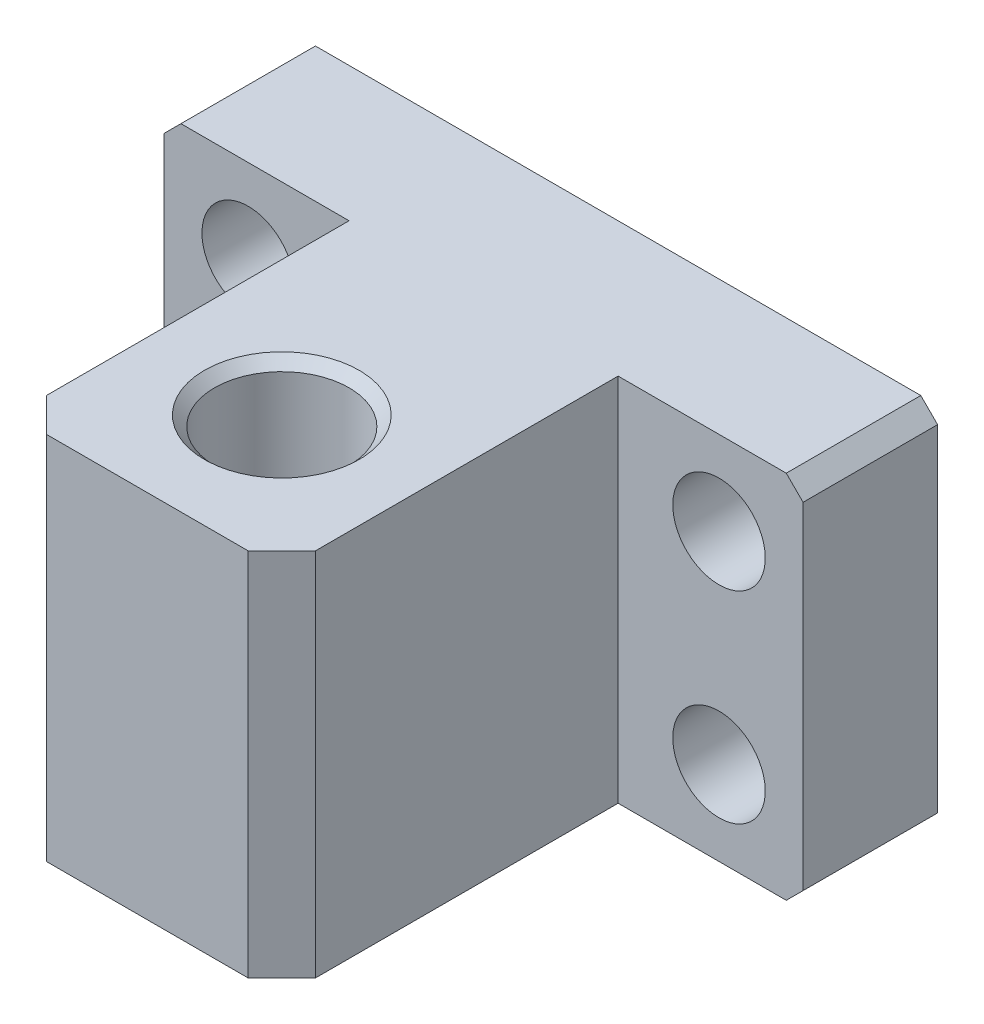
ISO-10303-21;
HEADER;
FILE_DESCRIPTION(('STEP AP214'),'2;1');
FILE_NAME('part.step','',(''),(''),'','','');
FILE_SCHEMA(('AUTOMOTIVE_DESIGN { 1 0 10303 214 1 1 1 1 }'));
ENDSEC;
DATA;
#1=APPLICATION_CONTEXT('core data for automotive mechanical design processes');
#2=APPLICATION_PROTOCOL_DEFINITION('international standard','automotive_design',2000,#1);
#3=PRODUCT_CONTEXT('',#1,'mechanical');
#4=PRODUCT('Part','Part','',(#3));
#5=PRODUCT_RELATED_PRODUCT_CATEGORY('part','',(#4));
#6=PRODUCT_DEFINITION_FORMATION('','',#4);
#7=PRODUCT_DEFINITION_CONTEXT('part definition',#1,'design');
#8=PRODUCT_DEFINITION('design','',#6,#7);
#9=PRODUCT_DEFINITION_SHAPE('','',#8);
#10=(LENGTH_UNIT() NAMED_UNIT(*) SI_UNIT(.MILLI.,.METRE.));
#11=(NAMED_UNIT(*) PLANE_ANGLE_UNIT() SI_UNIT($,.RADIAN.));
#12=(NAMED_UNIT(*) SI_UNIT($,.STERADIAN.) SOLID_ANGLE_UNIT());
#13=UNCERTAINTY_MEASURE_WITH_UNIT(LENGTH_MEASURE(1.E-05),#10,'distance_accuracy_value','');
#14=(GEOMETRIC_REPRESENTATION_CONTEXT(3) GLOBAL_UNCERTAINTY_ASSIGNED_CONTEXT((#13)) GLOBAL_UNIT_ASSIGNED_CONTEXT((#10,
#11,#12)) REPRESENTATION_CONTEXT('',''));
#15=CARTESIAN_POINT('',(0.,0.,0.));
#16=DIRECTION('',(0.,0.,1.));
#17=DIRECTION('',(1.,0.,0.));
#18=AXIS2_PLACEMENT_3D('',#15,#16,#17);
#19=CARTESIAN_POINT('',(-5.,17.,8.));
#20=DIRECTION('',(-1.,0.,0.));
#21=DIRECTION('',(0.,0.,-1.));
#22=AXIS2_PLACEMENT_3D('',#19,#20,#21);
#23=PLANE('',#22);
#24=DIRECTION('',(0.,-1.,0.));
#25=VECTOR('',#24,1.);
#26=CARTESIAN_POINT('',(-5.,17.,0.));
#27=LINE('',#26,#25);
#28=CARTESIAN_POINT('',(-5.,16.,0.));
#29=VERTEX_POINT('',#28);
#30=CARTESIAN_POINT('',(-5.,-4.,0.));
#31=VERTEX_POINT('',#30);
#32=EDGE_CURVE('E152',#29,#31,#27,.T.);
#33=ORIENTED_EDGE('',*,*,#32,.T.);
#34=DIRECTION('',(0.,0.,1.));
#35=VECTOR('',#34,1.);
#36=CARTESIAN_POINT('',(-5.,-4.,8.));
#37=LINE('',#36,#35);
#38=CARTESIAN_POINT('',(-5.,-4.,8.));
#39=VERTEX_POINT('',#38);
#40=EDGE_CURVE('E209',#31,#39,#37,.T.);
#41=ORIENTED_EDGE('',*,*,#40,.T.);
#42=DIRECTION('',(0.,-1.,0.));
#43=VECTOR('',#42,1.);
#44=CARTESIAN_POINT('',(-5.,17.,8.));
#45=LINE('',#44,#43);
#46=CARTESIAN_POINT('',(-5.,16.,8.));
#47=VERTEX_POINT('',#46);
#48=EDGE_CURVE('E168',#47,#39,#45,.T.);
#49=ORIENTED_EDGE('',*,*,#48,.F.);
#50=DIRECTION('',(0.,0.,-1.));
#51=VECTOR('',#50,1.);
#52=CARTESIAN_POINT('',(-5.,16.,8.));
#53=LINE('',#52,#51);
#54=EDGE_CURVE('E206',#47,#29,#53,.T.);
#55=ORIENTED_EDGE('',*,*,#54,.T.);
#56=EDGE_LOOP('',(#33,#41,#49,#55));
#57=FACE_BOUND('',#56,.T.);
#58=ADVANCED_FACE('F14',(#57),#23,.T.);
#59=CARTESIAN_POINT('',(6.,17.,8.));
#60=DIRECTION('',(0.,0.,1.));
#61=DIRECTION('',(-1.,0.,0.));
#62=AXIS2_PLACEMENT_3D('',#59,#60,#61);
#63=PLANE('',#62);
#64=CARTESIAN_POINT('',(0.,12.,8.));
#65=DIRECTION('',(0.,0.,1.));
#66=DIRECTION('',(0.,-1.,0.));
#67=AXIS2_PLACEMENT_3D('',#64,#65,#66);
#68=CIRCLE('',#67,2.75);
#69=CARTESIAN_POINT('',(0.,9.25,8.));
#70=VERTEX_POINT('',#69);
#71=EDGE_CURVE('E335',#70,#70,#68,.T.);
#72=ORIENTED_EDGE('',*,*,#71,.F.);
#73=EDGE_LOOP('',(#72));
#74=FACE_BOUND('',#73,.T.);
#75=CARTESIAN_POINT('',(0.,0.,8.));
#76=DIRECTION('',(0.,0.,1.));
#77=DIRECTION('',(0.,-1.,0.));
#78=AXIS2_PLACEMENT_3D('',#75,#76,#77);
#79=CIRCLE('',#78,2.75);
#80=CARTESIAN_POINT('',(0.,-2.75,8.));
#81=VERTEX_POINT('',#80);
#82=EDGE_CURVE('E317',#81,#81,#79,.T.);
#83=ORIENTED_EDGE('',*,*,#82,.F.);
#84=EDGE_LOOP('',(#83));
#85=FACE_BOUND('',#84,.T.);
#86=ORIENTED_EDGE('',*,*,#48,.T.);
#87=DIRECTION('',(0.707106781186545,-0.70710678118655,0.));
#88=VECTOR('',#87,1.);
#89=CARTESIAN_POINT('',(-10.,1.00000000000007,8.));
#90=LINE('',#89,#88);
#91=CARTESIAN_POINT('',(-4.,-5.,8.));
#92=VERTEX_POINT('',#91);
#93=EDGE_CURVE('E213',#39,#92,#90,.T.);
#94=ORIENTED_EDGE('',*,*,#93,.T.);
#95=DIRECTION('',(-1.,0.,0.));
#96=VECTOR('',#95,1.);
#97=CARTESIAN_POINT('',(6.,-5.,8.));
#98=LINE('',#97,#96);
#99=CARTESIAN_POINT('',(6.,-5.,8.));
#100=VERTEX_POINT('',#99);
#101=EDGE_CURVE('E165',#100,#92,#98,.T.);
#102=ORIENTED_EDGE('',*,*,#101,.F.);
#103=DIRECTION('',(0.,-1.,0.));
#104=VECTOR('',#103,1.);
#105=CARTESIAN_POINT('',(6.,17.,8.));
#106=LINE('',#105,#104);
#107=CARTESIAN_POINT('',(6.,17.,8.));
#108=VERTEX_POINT('',#107);
#109=EDGE_CURVE('E137',#108,#100,#106,.T.);
#110=ORIENTED_EDGE('',*,*,#109,.F.);
#111=DIRECTION('',(-1.,0.,0.));
#112=VECTOR('',#111,1.);
#113=CARTESIAN_POINT('',(6.,17.,8.));
#114=LINE('',#113,#112);
#115=CARTESIAN_POINT('',(-4.,17.,8.));
#116=VERTEX_POINT('',#115);
#117=EDGE_CURVE('E149',#108,#116,#114,.T.);
#118=ORIENTED_EDGE('',*,*,#117,.T.);
#119=DIRECTION('',(0.707106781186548,0.707106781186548,0.));
#120=VECTOR('',#119,1.);
#121=CARTESIAN_POINT('',(1.,22.,8.));
#122=LINE('',#121,#120);
#123=EDGE_CURVE('E211',#116,#47,#122,.F.);
#124=ORIENTED_EDGE('',*,*,#123,.T.);
#125=EDGE_LOOP('',(#86,#94,#102,#110,#118,#124));
#126=FACE_BOUND('',#125,.T.);
#127=ADVANCED_FACE('F250',(#74,#85,#126),#63,.T.);
#128=CARTESIAN_POINT('',(6.,17.,28.));
#129=DIRECTION('',(-1.,0.,0.));
#130=DIRECTION('',(0.,0.,-1.));
#131=AXIS2_PLACEMENT_3D('',#128,#129,#130);
#132=PLANE('',#131);
#133=DIRECTION('',(0.,0.,-1.));
#134=VECTOR('',#133,1.);
#135=CARTESIAN_POINT('',(6.,-5.,28.));
#136=LINE('',#135,#134);
#137=CARTESIAN_POINT('',(6.,-5.,26.));
#138=VERTEX_POINT('',#137);
#139=EDGE_CURVE('E163',#138,#100,#136,.T.);
#140=ORIENTED_EDGE('',*,*,#139,.F.);
#141=DIRECTION('',(0.,1.,0.));
#142=VECTOR('',#141,1.);
#143=CARTESIAN_POINT('',(6.,17.,26.));
#144=LINE('',#143,#142);
#145=CARTESIAN_POINT('',(6.,17.,26.));
#146=VERTEX_POINT('',#145);
#147=EDGE_CURVE('E38',#138,#146,#144,.T.);
#148=ORIENTED_EDGE('',*,*,#147,.T.);
#149=DIRECTION('',(0.,0.,-1.));
#150=VECTOR('',#149,1.);
#151=CARTESIAN_POINT('',(6.,17.,28.));
#152=LINE('',#151,#150);
#153=EDGE_CURVE('E144',#146,#108,#152,.T.);
#154=ORIENTED_EDGE('',*,*,#153,.T.);
#155=ORIENTED_EDGE('',*,*,#109,.T.);
#156=EDGE_LOOP('',(#140,#148,#154,#155));
#157=FACE_BOUND('',#156,.T.);
#158=ADVANCED_FACE('F256',(#157),#132,.T.);
#159=CARTESIAN_POINT('',(22.,17.,28.));
#160=DIRECTION('',(0.,0.,1.));
#161=DIRECTION('',(0.,-1.,0.));
#162=AXIS2_PLACEMENT_3D('',#159,#160,#161);
#163=PLANE('',#162);
#164=DIRECTION('',(-1.,0.,0.));
#165=VECTOR('',#164,1.);
#166=CARTESIAN_POINT('',(22.,17.,28.));
#167=LINE('',#166,#165);
#168=CARTESIAN_POINT('',(20.,17.,28.));
#169=VERTEX_POINT('',#168);
#170=CARTESIAN_POINT('',(8.,17.,28.));
#171=VERTEX_POINT('',#170);
#172=EDGE_CURVE('E141',#169,#171,#167,.T.);
#173=ORIENTED_EDGE('',*,*,#172,.T.);
#174=DIRECTION('',(0.,-1.,0.));
#175=VECTOR('',#174,1.);
#176=CARTESIAN_POINT('',(8.,17.,28.));
#177=LINE('',#176,#175);
#178=CARTESIAN_POINT('',(8.,-5.,28.));
#179=VERTEX_POINT('',#178);
#180=EDGE_CURVE('E217',#171,#179,#177,.T.);
#181=ORIENTED_EDGE('',*,*,#180,.T.);
#182=DIRECTION('',(-1.,0.,0.));
#183=VECTOR('',#182,1.);
#184=CARTESIAN_POINT('',(22.,-5.,28.));
#185=LINE('',#184,#183);
#186=CARTESIAN_POINT('',(20.,-5.,28.));
#187=VERTEX_POINT('',#186);
#188=EDGE_CURVE('E160',#187,#179,#185,.T.);
#189=ORIENTED_EDGE('',*,*,#188,.F.);
#190=DIRECTION('',(0.,1.,0.));
#191=VECTOR('',#190,1.);
#192=CARTESIAN_POINT('',(20.,17.,28.));
#193=LINE('',#192,#191);
#194=EDGE_CURVE('E215',#187,#169,#193,.T.);
#195=ORIENTED_EDGE('',*,*,#194,.T.);
#196=EDGE_LOOP('',(#173,#181,#189,#195));
#197=FACE_BOUND('',#196,.T.);
#198=ADVANCED_FACE('F288',(#197),#163,.T.);
#199=CARTESIAN_POINT('',(22.,17.,8.));
#200=DIRECTION('',(1.,0.,0.));
#201=DIRECTION('',(0.,0.,1.));
#202=AXIS2_PLACEMENT_3D('',#199,#200,#201);
#203=PLANE('',#202);
#204=DIRECTION('',(0.,0.,1.));
#205=VECTOR('',#204,1.);
#206=CARTESIAN_POINT('',(22.,17.,8.));
#207=LINE('',#206,#205);
#208=CARTESIAN_POINT('',(22.,17.,8.));
#209=VERTEX_POINT('',#208);
#210=CARTESIAN_POINT('',(22.,17.,26.));
#211=VERTEX_POINT('',#210);
#212=EDGE_CURVE('E128',#209,#211,#207,.T.);
#213=ORIENTED_EDGE('',*,*,#212,.T.);
#214=DIRECTION('',(0.,-1.,0.));
#215=VECTOR('',#214,1.);
#216=CARTESIAN_POINT('',(22.,17.,26.));
#217=LINE('',#216,#215);
#218=CARTESIAN_POINT('',(22.,-5.,26.));
#219=VERTEX_POINT('',#218);
#220=EDGE_CURVE('E228',#211,#219,#217,.T.);
#221=ORIENTED_EDGE('',*,*,#220,.T.);
#222=DIRECTION('',(0.,0.,1.));
#223=VECTOR('',#222,1.);
#224=CARTESIAN_POINT('',(22.,-5.,8.));
#225=LINE('',#224,#223);
#226=CARTESIAN_POINT('',(22.,-5.,8.));
#227=VERTEX_POINT('',#226);
#228=EDGE_CURVE('E136',#227,#219,#225,.T.);
#229=ORIENTED_EDGE('',*,*,#228,.F.);
#230=DIRECTION('',(0.,-1.,0.));
#231=VECTOR('',#230,1.);
#232=CARTESIAN_POINT('',(22.,17.,8.));
#233=LINE('',#232,#231);
#234=EDGE_CURVE('E123',#209,#227,#233,.T.);
#235=ORIENTED_EDGE('',*,*,#234,.F.);
#236=EDGE_LOOP('',(#213,#221,#229,#235));
#237=FACE_BOUND('',#236,.T.);
#238=ADVANCED_FACE('F132',(#237),#203,.T.);
#239=CARTESIAN_POINT('',(33.,17.,8.));
#240=DIRECTION('',(0.,0.,1.));
#241=DIRECTION('',(-1.,0.,0.));
#242=AXIS2_PLACEMENT_3D('',#239,#240,#241);
#243=PLANE('',#242);
#244=CARTESIAN_POINT('',(28.,12.,8.));
#245=DIRECTION('',(0.,0.,1.));
#246=DIRECTION('',(0.,-1.,0.));
#247=AXIS2_PLACEMENT_3D('',#244,#245,#246);
#248=CIRCLE('',#247,2.75);
#249=CARTESIAN_POINT('',(28.,9.25,8.));
#250=VERTEX_POINT('',#249);
#251=EDGE_CURVE('E329',#250,#250,#248,.T.);
#252=ORIENTED_EDGE('',*,*,#251,.F.);
#253=EDGE_LOOP('',(#252));
#254=FACE_BOUND('',#253,.T.);
#255=CARTESIAN_POINT('',(28.,0.,8.));
#256=DIRECTION('',(0.,0.,1.));
#257=DIRECTION('',(0.,-1.,0.));
#258=AXIS2_PLACEMENT_3D('',#255,#256,#257);
#259=CIRCLE('',#258,2.75);
#260=CARTESIAN_POINT('',(28.,-2.75,8.));
#261=VERTEX_POINT('',#260);
#262=EDGE_CURVE('E323',#261,#261,#259,.T.);
#263=ORIENTED_EDGE('',*,*,#262,.F.);
#264=EDGE_LOOP('',(#263));
#265=FACE_BOUND('',#264,.T.);
#266=DIRECTION('',(-1.,0.,0.));
#267=VECTOR('',#266,1.);
#268=CARTESIAN_POINT('',(33.,-5.,8.));
#269=LINE('',#268,#267);
#270=CARTESIAN_POINT('',(32.,-5.,8.));
#271=VERTEX_POINT('',#270);
#272=EDGE_CURVE('E156',#271,#227,#269,.T.);
#273=ORIENTED_EDGE('',*,*,#272,.F.);
#274=DIRECTION('',(0.707106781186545,0.70710678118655,0.));
#275=VECTOR('',#274,1.);
#276=CARTESIAN_POINT('',(43.5,6.50000000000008,8.));
#277=LINE('',#276,#275);
#278=CARTESIAN_POINT('',(33.,-4.,8.));
#279=VERTEX_POINT('',#278);
#280=EDGE_CURVE('E187',#271,#279,#277,.T.);
#281=ORIENTED_EDGE('',*,*,#280,.T.);
#282=DIRECTION('',(0.,-1.,0.));
#283=VECTOR('',#282,1.);
#284=CARTESIAN_POINT('',(33.,17.,8.));
#285=LINE('',#284,#283);
#286=CARTESIAN_POINT('',(33.,16.,8.));
#287=VERTEX_POINT('',#286);
#288=EDGE_CURVE('E138',#287,#279,#285,.T.);
#289=ORIENTED_EDGE('',*,*,#288,.F.);
#290=DIRECTION('',(0.707106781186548,-0.707106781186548,0.));
#291=VECTOR('',#290,1.);
#292=CARTESIAN_POINT('',(32.5,16.5,8.));
#293=LINE('',#292,#291);
#294=CARTESIAN_POINT('',(32.,17.,8.));
#295=VERTEX_POINT('',#294);
#296=EDGE_CURVE('E126',#287,#295,#293,.F.);
#297=ORIENTED_EDGE('',*,*,#296,.T.);
#298=DIRECTION('',(-1.,0.,0.));
#299=VECTOR('',#298,1.);
#300=CARTESIAN_POINT('',(33.,17.,8.));
#301=LINE('',#300,#299);
#302=EDGE_CURVE('E119',#295,#209,#301,.T.);
#303=ORIENTED_EDGE('',*,*,#302,.T.);
#304=ORIENTED_EDGE('',*,*,#234,.T.);
#305=EDGE_LOOP('',(#273,#281,#289,#297,#303,#304));
#306=FACE_BOUND('',#305,.T.);
#307=ADVANCED_FACE('F122',(#254,#265,#306),#243,.T.);
#308=CARTESIAN_POINT('',(33.,17.,0.));
#309=DIRECTION('',(1.,0.,0.));
#310=DIRECTION('',(0.,0.,1.));
#311=AXIS2_PLACEMENT_3D('',#308,#309,#310);
#312=PLANE('',#311);
#313=ORIENTED_EDGE('',*,*,#288,.T.);
#314=DIRECTION('',(0.,0.,-1.));
#315=VECTOR('',#314,1.);
#316=CARTESIAN_POINT('',(33.,-4.,0.));
#317=LINE('',#316,#315);
#318=CARTESIAN_POINT('',(33.,-4.,0.));
#319=VERTEX_POINT('',#318);
#320=EDGE_CURVE('E192',#279,#319,#317,.T.);
#321=ORIENTED_EDGE('',*,*,#320,.T.);
#322=DIRECTION('',(0.,-1.,0.));
#323=VECTOR('',#322,1.);
#324=CARTESIAN_POINT('',(33.,17.,0.));
#325=LINE('',#324,#323);
#326=CARTESIAN_POINT('',(33.,16.,0.));
#327=VERTEX_POINT('',#326);
#328=EDGE_CURVE('E176',#327,#319,#325,.T.);
#329=ORIENTED_EDGE('',*,*,#328,.F.);
#330=DIRECTION('',(0.,0.,1.));
#331=VECTOR('',#330,1.);
#332=CARTESIAN_POINT('',(33.,16.,0.));
#333=LINE('',#332,#331);
#334=EDGE_CURVE('E189',#327,#287,#333,.T.);
#335=ORIENTED_EDGE('',*,*,#334,.T.);
#336=EDGE_LOOP('',(#313,#321,#329,#335));
#337=FACE_BOUND('',#336,.T.);
#338=ADVANCED_FACE('F296',(#337),#312,.T.);
#339=CARTESIAN_POINT('',(-5.,17.,0.));
#340=DIRECTION('',(0.,0.,-1.));
#341=DIRECTION('',(0.,1.,0.));
#342=AXIS2_PLACEMENT_3D('',#339,#340,#341);
#343=PLANE('',#342);
#344=CARTESIAN_POINT('',(0.,12.,0.));
#345=DIRECTION('',(0.,0.,-1.));
#346=DIRECTION('',(0.,1.,0.));
#347=AXIS2_PLACEMENT_3D('',#344,#345,#346);
#348=CIRCLE('',#347,2.75);
#349=CARTESIAN_POINT('',(0.,14.75,0.));
#350=VERTEX_POINT('',#349);
#351=EDGE_CURVE('E332',#350,#350,#348,.T.);
#352=ORIENTED_EDGE('',*,*,#351,.F.);
#353=EDGE_LOOP('',(#352));
#354=FACE_BOUND('',#353,.T.);
#355=CARTESIAN_POINT('',(28.,12.,0.));
#356=DIRECTION('',(0.,0.,-1.));
#357=DIRECTION('',(0.,1.,0.));
#358=AXIS2_PLACEMENT_3D('',#355,#356,#357);
#359=CIRCLE('',#358,2.75);
#360=CARTESIAN_POINT('',(28.,14.75,0.));
#361=VERTEX_POINT('',#360);
#362=EDGE_CURVE('E326',#361,#361,#359,.T.);
#363=ORIENTED_EDGE('',*,*,#362,.F.);
#364=EDGE_LOOP('',(#363));
#365=FACE_BOUND('',#364,.T.);
#366=CARTESIAN_POINT('',(28.,0.,0.));
#367=DIRECTION('',(0.,0.,-1.));
#368=DIRECTION('',(0.,1.,0.));
#369=AXIS2_PLACEMENT_3D('',#366,#367,#368);
#370=CIRCLE('',#369,2.75);
#371=CARTESIAN_POINT('',(28.,2.75,0.));
#372=VERTEX_POINT('',#371);
#373=EDGE_CURVE('E320',#372,#372,#370,.T.);
#374=ORIENTED_EDGE('',*,*,#373,.F.);
#375=EDGE_LOOP('',(#374));
#376=FACE_BOUND('',#375,.T.);
#377=CARTESIAN_POINT('',(0.,0.,0.));
#378=DIRECTION('',(0.,0.,-1.));
#379=DIRECTION('',(0.,1.,0.));
#380=AXIS2_PLACEMENT_3D('',#377,#378,#379);
#381=CIRCLE('',#380,2.75);
#382=CARTESIAN_POINT('',(0.,2.75,0.));
#383=VERTEX_POINT('',#382);
#384=EDGE_CURVE('E157',#383,#383,#381,.T.);
#385=ORIENTED_EDGE('',*,*,#384,.F.);
#386=EDGE_LOOP('',(#385));
#387=FACE_BOUND('',#386,.T.);
#388=ORIENTED_EDGE('',*,*,#328,.T.);
#389=DIRECTION('',(-0.707106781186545,-0.70710678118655,0.));
#390=VECTOR('',#389,1.);
#391=CARTESIAN_POINT('',(24.5,-12.5,0.));
#392=LINE('',#391,#390);
#393=CARTESIAN_POINT('',(32.,-5.,0.));
#394=VERTEX_POINT('',#393);
#395=EDGE_CURVE('E200',#319,#394,#392,.T.);
#396=ORIENTED_EDGE('',*,*,#395,.T.);
#397=DIRECTION('',(1.,0.,0.));
#398=VECTOR('',#397,1.);
#399=CARTESIAN_POINT('',(-5.,-5.,0.));
#400=LINE('',#399,#398);
#401=CARTESIAN_POINT('',(-4.,-5.,0.));
#402=VERTEX_POINT('',#401);
#403=EDGE_CURVE('E153',#402,#394,#400,.T.);
#404=ORIENTED_EDGE('',*,*,#403,.F.);
#405=DIRECTION('',(-0.707106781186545,0.70710678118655,0.));
#406=VECTOR('',#405,1.);
#407=CARTESIAN_POINT('',(-15.5,6.50000000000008,0.));
#408=LINE('',#407,#406);
#409=EDGE_CURVE('E196',#402,#31,#408,.T.);
#410=ORIENTED_EDGE('',*,*,#409,.T.);
#411=ORIENTED_EDGE('',*,*,#32,.F.);
#412=DIRECTION('',(-0.707106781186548,-0.707106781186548,0.));
#413=VECTOR('',#412,1.);
#414=CARTESIAN_POINT('',(-4.5,16.5,0.));
#415=LINE('',#414,#413);
#416=CARTESIAN_POINT('',(-4.,17.,0.));
#417=VERTEX_POINT('',#416);
#418=EDGE_CURVE('E194',#29,#417,#415,.F.);
#419=ORIENTED_EDGE('',*,*,#418,.T.);
#420=DIRECTION('',(1.,0.,0.));
#421=VECTOR('',#420,1.);
#422=CARTESIAN_POINT('',(-5.,17.,0.));
#423=LINE('',#422,#421);
#424=CARTESIAN_POINT('',(32.,17.,0.));
#425=VERTEX_POINT('',#424);
#426=EDGE_CURVE('E129',#417,#425,#423,.T.);
#427=ORIENTED_EDGE('',*,*,#426,.T.);
#428=DIRECTION('',(-0.707106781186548,0.707106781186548,0.));
#429=VECTOR('',#428,1.);
#430=CARTESIAN_POINT('',(13.5,35.5,0.));
#431=LINE('',#430,#429);
#432=EDGE_CURVE('E198',#425,#327,#431,.F.);
#433=ORIENTED_EDGE('',*,*,#432,.T.);
#434=EDGE_LOOP('',(#388,#396,#404,#410,#411,#419,#427,#433));
#435=FACE_BOUND('',#434,.T.);
#436=ADVANCED_FACE('F261',(#354,#365,#376,#387,#435),#343,.T.);
#437=CARTESIAN_POINT('',(-5.,17.,8.));
#438=DIRECTION('',(0.,1.,0.));
#439=DIRECTION('',(-1.,0.,0.));
#440=AXIS2_PLACEMENT_3D('',#437,#438,#439);
#441=PLANE('',#440);
#442=CARTESIAN_POINT('',(14.,17.,20.));
#443=DIRECTION('',(0.,1.,0.));
#444=DIRECTION('',(-1.,0.,0.));
#445=AXIS2_PLACEMENT_3D('',#442,#443,#444);
#446=CIRCLE('',#445,4.6);
#447=CARTESIAN_POINT('',(9.4,17.,20.));
#448=VERTEX_POINT('',#447);
#449=EDGE_CURVE('E23',#448,#448,#446,.F.);
#450=ORIENTED_EDGE('',*,*,#449,.T.);
#451=EDGE_LOOP('',(#450));
#452=FACE_BOUND('',#451,.T.);
#453=ORIENTED_EDGE('',*,*,#153,.F.);
#454=DIRECTION('',(-0.707106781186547,0.,-0.707106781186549));
#455=VECTOR('',#454,1.);
#456=CARTESIAN_POINT('',(-8.5,17.,11.5));
#457=LINE('',#456,#455);
#458=EDGE_CURVE('E226',#146,#171,#457,.F.);
#459=ORIENTED_EDGE('',*,*,#458,.T.);
#460=ORIENTED_EDGE('',*,*,#172,.F.);
#461=DIRECTION('',(-0.707106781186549,0.,0.707106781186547));
#462=VECTOR('',#461,1.);
#463=CARTESIAN_POINT('',(17.5,17.,30.5));
#464=LINE('',#463,#462);
#465=EDGE_CURVE('E30',#169,#211,#464,.F.);
#466=ORIENTED_EDGE('',*,*,#465,.T.);
#467=ORIENTED_EDGE('',*,*,#212,.F.);
#468=ORIENTED_EDGE('',*,*,#302,.F.);
#469=DIRECTION('',(0.,0.,-1.));
#470=VECTOR('',#469,1.);
#471=CARTESIAN_POINT('',(32.,17.,8.));
#472=LINE('',#471,#470);
#473=EDGE_CURVE('E204',#295,#425,#472,.T.);
#474=ORIENTED_EDGE('',*,*,#473,.T.);
#475=ORIENTED_EDGE('',*,*,#426,.F.);
#476=DIRECTION('',(0.,0.,1.));
#477=VECTOR('',#476,1.);
#478=CARTESIAN_POINT('',(-4.,17.,8.));
#479=LINE('',#478,#477);
#480=EDGE_CURVE('E202',#417,#116,#479,.T.);
#481=ORIENTED_EDGE('',*,*,#480,.T.);
#482=ORIENTED_EDGE('',*,*,#117,.F.);
#483=EDGE_LOOP('',(#453,#459,#460,#466,#467,#468,#474,#475,#481,#482));
#484=FACE_BOUND('',#483,.T.);
#485=ADVANCED_FACE('F140',(#452,#484),#441,.T.);
#486=CARTESIAN_POINT('',(-5.,-5.,8.));
#487=DIRECTION('',(0.,1.,0.));
#488=DIRECTION('',(-1.,0.,0.));
#489=AXIS2_PLACEMENT_3D('',#486,#487,#488);
#490=PLANE('',#489);
#491=CARTESIAN_POINT('',(14.,-5.,20.));
#492=DIRECTION('',(0.,1.,0.));
#493=DIRECTION('',(-1.,0.,0.));
#494=AXIS2_PLACEMENT_3D('',#491,#492,#493);
#495=CIRCLE('',#494,4.6);
#496=CARTESIAN_POINT('',(9.4,-5.,20.));
#497=VERTEX_POINT('',#496);
#498=EDGE_CURVE('E9',#497,#497,#495,.T.);
#499=ORIENTED_EDGE('',*,*,#498,.T.);
#500=EDGE_LOOP('',(#499));
#501=FACE_BOUND('',#500,.T.);
#502=ORIENTED_EDGE('',*,*,#188,.T.);
#503=DIRECTION('',(0.707106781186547,0.,0.707106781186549));
#504=VECTOR('',#503,1.);
#505=CARTESIAN_POINT('',(8.,-5.,28.));
#506=LINE('',#505,#504);
#507=EDGE_CURVE('E222',#179,#138,#506,.F.);
#508=ORIENTED_EDGE('',*,*,#507,.T.);
#509=ORIENTED_EDGE('',*,*,#139,.T.);
#510=ORIENTED_EDGE('',*,*,#101,.T.);
#511=DIRECTION('',(0.,0.,-1.));
#512=VECTOR('',#511,1.);
#513=CARTESIAN_POINT('',(-4.,-5.,0.));
#514=LINE('',#513,#512);
#515=EDGE_CURVE('E171',#92,#402,#514,.T.);
#516=ORIENTED_EDGE('',*,*,#515,.T.);
#517=ORIENTED_EDGE('',*,*,#403,.T.);
#518=DIRECTION('',(0.,0.,1.));
#519=VECTOR('',#518,1.);
#520=CARTESIAN_POINT('',(32.,-5.,8.));
#521=LINE('',#520,#519);
#522=EDGE_CURVE('E183',#394,#271,#521,.T.);
#523=ORIENTED_EDGE('',*,*,#522,.T.);
#524=ORIENTED_EDGE('',*,*,#272,.T.);
#525=ORIENTED_EDGE('',*,*,#228,.T.);
#526=DIRECTION('',(0.707106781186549,0.,-0.707106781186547));
#527=VECTOR('',#526,1.);
#528=CARTESIAN_POINT('',(22.,-5.,26.));
#529=LINE('',#528,#527);
#530=EDGE_CURVE('E220',#219,#187,#529,.F.);
#531=ORIENTED_EDGE('',*,*,#530,.T.);
#532=EDGE_LOOP('',(#502,#508,#509,#510,#516,#517,#523,#524,#525,#531));
#533=FACE_BOUND('',#532,.T.);
#534=ADVANCED_FACE('F292',(#501,#533),#490,.F.);
#535=CARTESIAN_POINT('',(0.,0.,8.));
#536=DIRECTION('',(0.,0.,1.));
#537=DIRECTION('',(0.,-1.,0.));
#538=AXIS2_PLACEMENT_3D('',#535,#536,#537);
#539=CYLINDRICAL_SURFACE('',#538,2.75);
#540=ORIENTED_EDGE('',*,*,#82,.T.);
#541=EDGE_LOOP('',(#540));
#542=FACE_BOUND('',#541,.T.);
#543=ORIENTED_EDGE('',*,*,#384,.T.);
#544=EDGE_LOOP('',(#543));
#545=FACE_BOUND('',#544,.T.);
#546=ADVANCED_FACE('F348',(#542,#545),#539,.F.);
#547=CARTESIAN_POINT('',(28.,0.,8.));
#548=DIRECTION('',(0.,0.,1.));
#549=DIRECTION('',(0.,-1.,0.));
#550=AXIS2_PLACEMENT_3D('',#547,#548,#549);
#551=CYLINDRICAL_SURFACE('',#550,2.75);
#552=ORIENTED_EDGE('',*,*,#262,.T.);
#553=EDGE_LOOP('',(#552));
#554=FACE_BOUND('',#553,.T.);
#555=ORIENTED_EDGE('',*,*,#373,.T.);
#556=EDGE_LOOP('',(#555));
#557=FACE_BOUND('',#556,.T.);
#558=ADVANCED_FACE('F354',(#554,#557),#551,.F.);
#559=CARTESIAN_POINT('',(28.,12.,8.));
#560=DIRECTION('',(0.,0.,1.));
#561=DIRECTION('',(0.,-1.,0.));
#562=AXIS2_PLACEMENT_3D('',#559,#560,#561);
#563=CYLINDRICAL_SURFACE('',#562,2.75);
#564=ORIENTED_EDGE('',*,*,#251,.T.);
#565=EDGE_LOOP('',(#564));
#566=FACE_BOUND('',#565,.T.);
#567=ORIENTED_EDGE('',*,*,#362,.T.);
#568=EDGE_LOOP('',(#567));
#569=FACE_BOUND('',#568,.T.);
#570=ADVANCED_FACE('F384',(#566,#569),#563,.F.);
#571=CARTESIAN_POINT('',(0.,12.,8.));
#572=DIRECTION('',(0.,0.,1.));
#573=DIRECTION('',(0.,-1.,0.));
#574=AXIS2_PLACEMENT_3D('',#571,#572,#573);
#575=CYLINDRICAL_SURFACE('',#574,2.75);
#576=ORIENTED_EDGE('',*,*,#71,.T.);
#577=EDGE_LOOP('',(#576));
#578=FACE_BOUND('',#577,.T.);
#579=ORIENTED_EDGE('',*,*,#351,.T.);
#580=EDGE_LOOP('',(#579));
#581=FACE_BOUND('',#580,.T.);
#582=ADVANCED_FACE('F267',(#578,#581),#575,.F.);
#583=CARTESIAN_POINT('',(32.,-5.,8.));
#584=DIRECTION('',(0.70710678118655,-0.707106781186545,0.));
#585=DIRECTION('',(0.707106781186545,0.70710678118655,0.));
#586=AXIS2_PLACEMENT_3D('',#583,#584,#585);
#587=PLANE('',#586);
#588=ORIENTED_EDGE('',*,*,#395,.F.);
#589=ORIENTED_EDGE('',*,*,#320,.F.);
#590=ORIENTED_EDGE('',*,*,#280,.F.);
#591=ORIENTED_EDGE('',*,*,#522,.F.);
#592=EDGE_LOOP('',(#588,#589,#590,#591));
#593=FACE_BOUND('',#592,.T.);
#594=ADVANCED_FACE('F263',(#593),#587,.T.);
#595=CARTESIAN_POINT('',(33.,16.,0.));
#596=DIRECTION('',(-0.707106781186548,-0.707106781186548,0.));
#597=DIRECTION('',(0.707106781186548,-0.707106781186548,0.));
#598=AXIS2_PLACEMENT_3D('',#595,#596,#597);
#599=PLANE('',#598);
#600=ORIENTED_EDGE('',*,*,#432,.F.);
#601=ORIENTED_EDGE('',*,*,#473,.F.);
#602=ORIENTED_EDGE('',*,*,#296,.F.);
#603=ORIENTED_EDGE('',*,*,#334,.F.);
#604=EDGE_LOOP('',(#600,#601,#602,#603));
#605=FACE_BOUND('',#604,.T.);
#606=ADVANCED_FACE('F266',(#605),#599,.F.);
#607=CARTESIAN_POINT('',(-4.,-5.,8.));
#608=DIRECTION('',(-0.70710678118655,-0.707106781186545,0.));
#609=DIRECTION('',(0.707106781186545,-0.70710678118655,0.));
#610=AXIS2_PLACEMENT_3D('',#607,#608,#609);
#611=PLANE('',#610);
#612=ORIENTED_EDGE('',*,*,#93,.F.);
#613=ORIENTED_EDGE('',*,*,#40,.F.);
#614=ORIENTED_EDGE('',*,*,#409,.F.);
#615=ORIENTED_EDGE('',*,*,#515,.F.);
#616=EDGE_LOOP('',(#612,#613,#614,#615));
#617=FACE_BOUND('',#616,.T.);
#618=ADVANCED_FACE('F271',(#617),#611,.T.);
#619=CARTESIAN_POINT('',(-5.,16.,8.));
#620=DIRECTION('',(0.707106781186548,-0.707106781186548,0.));
#621=DIRECTION('',(0.707106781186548,0.707106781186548,0.));
#622=AXIS2_PLACEMENT_3D('',#619,#620,#621);
#623=PLANE('',#622);
#624=ORIENTED_EDGE('',*,*,#123,.F.);
#625=ORIENTED_EDGE('',*,*,#480,.F.);
#626=ORIENTED_EDGE('',*,*,#418,.F.);
#627=ORIENTED_EDGE('',*,*,#54,.F.);
#628=EDGE_LOOP('',(#624,#625,#626,#627));
#629=FACE_BOUND('',#628,.T.);
#630=ADVANCED_FACE('F275',(#629),#623,.F.);
#631=CARTESIAN_POINT('',(8.,17.,28.));
#632=DIRECTION('',(0.707106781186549,0.,-0.707106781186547));
#633=DIRECTION('',(0.707106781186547,0.,0.707106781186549));
#634=AXIS2_PLACEMENT_3D('',#631,#632,#633);
#635=PLANE('',#634);
#636=ORIENTED_EDGE('',*,*,#458,.F.);
#637=ORIENTED_EDGE('',*,*,#147,.F.);
#638=ORIENTED_EDGE('',*,*,#507,.F.);
#639=ORIENTED_EDGE('',*,*,#180,.F.);
#640=EDGE_LOOP('',(#636,#637,#638,#639));
#641=FACE_BOUND('',#640,.T.);
#642=ADVANCED_FACE('F245',(#641),#635,.F.);
#643=CARTESIAN_POINT('',(22.,17.,26.));
#644=DIRECTION('',(-0.707106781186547,0.,-0.707106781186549));
#645=DIRECTION('',(0.707106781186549,0.,-0.707106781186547));
#646=AXIS2_PLACEMENT_3D('',#643,#644,#645);
#647=PLANE('',#646);
#648=ORIENTED_EDGE('',*,*,#465,.F.);
#649=ORIENTED_EDGE('',*,*,#194,.F.);
#650=ORIENTED_EDGE('',*,*,#530,.F.);
#651=ORIENTED_EDGE('',*,*,#220,.F.);
#652=EDGE_LOOP('',(#648,#649,#650,#651));
#653=FACE_BOUND('',#652,.T.);
#654=ADVANCED_FACE('F236',(#653),#647,.F.);
#655=CARTESIAN_POINT('',(14.,15.8,20.));
#656=DIRECTION('',(0.,1.,0.));
#657=DIRECTION('',(-1.,0.,0.));
#658=AXIS2_PLACEMENT_3D('',#655,#656,#657);
#659=CONICAL_SURFACE('',#658,3.4,0.785398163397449);
#660=CARTESIAN_POINT('',(14.,16.4,20.));
#661=DIRECTION('',(0.,1.,0.));
#662=DIRECTION('',(0.,0.,1.));
#663=AXIS2_PLACEMENT_3D('',#660,#661,#662);
#664=CIRCLE('',#663,4.);
#665=CARTESIAN_POINT('',(14.,16.4,24.));
#666=VERTEX_POINT('',#665);
#667=EDGE_CURVE('E338',#666,#666,#664,.T.);
#668=ORIENTED_EDGE('',*,*,#667,.F.);
#669=EDGE_LOOP('',(#668));
#670=FACE_BOUND('',#669,.T.);
#671=ORIENTED_EDGE('',*,*,#449,.F.);
#672=EDGE_LOOP('',(#671));
#673=FACE_BOUND('',#672,.T.);
#674=ADVANCED_FACE('F234',(#670,#673),#659,.F.);
#675=CARTESIAN_POINT('',(14.,-5.,20.));
#676=DIRECTION('',(0.,-1.,0.));
#677=DIRECTION('',(1.,0.,0.));
#678=AXIS2_PLACEMENT_3D('',#675,#676,#677);
#679=CONICAL_SURFACE('',#678,4.6,0.785398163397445);
#680=CARTESIAN_POINT('',(14.,-4.4,20.));
#681=DIRECTION('',(0.,-1.,0.));
#682=DIRECTION('',(0.,0.,-1.));
#683=AXIS2_PLACEMENT_3D('',#680,#681,#682);
#684=CIRCLE('',#683,4.);
#685=CARTESIAN_POINT('',(14.,-4.4,16.));
#686=VERTEX_POINT('',#685);
#687=EDGE_CURVE('E18',#686,#686,#684,.T.);
#688=ORIENTED_EDGE('',*,*,#687,.F.);
#689=EDGE_LOOP('',(#688));
#690=FACE_BOUND('',#689,.T.);
#691=ORIENTED_EDGE('',*,*,#498,.F.);
#692=EDGE_LOOP('',(#691));
#693=FACE_BOUND('',#692,.T.);
#694=ADVANCED_FACE('F16',(#690,#693),#679,.F.);
#695=CARTESIAN_POINT('',(14.,-5.,20.));
#696=DIRECTION('',(0.,1.,0.));
#697=DIRECTION('',(0.,0.,1.));
#698=AXIS2_PLACEMENT_3D('',#695,#696,#697);
#699=CYLINDRICAL_SURFACE('',#698,4.);
#700=ORIENTED_EDGE('',*,*,#667,.T.);
#701=EDGE_LOOP('',(#700));
#702=FACE_BOUND('',#701,.T.);
#703=ORIENTED_EDGE('',*,*,#687,.T.);
#704=EDGE_LOOP('',(#703));
#705=FACE_BOUND('',#704,.T.);
#706=ADVANCED_FACE('F243',(#702,#705),#699,.F.);
#707=CLOSED_SHELL('',(#58,#127,#158,#198,#238,#307,#338,#436,#485,#534,#546,#558,#570,#582,#594,
#606,#618,#630,#642,#654,#674,#694,#706));
#708=MANIFOLD_SOLID_BREP('B1',#707);
#709=ADVANCED_BREP_SHAPE_REPRESENTATION('',(#18,#708),#14);
#710=SHAPE_DEFINITION_REPRESENTATION(#9,#709);
ENDSEC;
END-ISO-10303-21;
